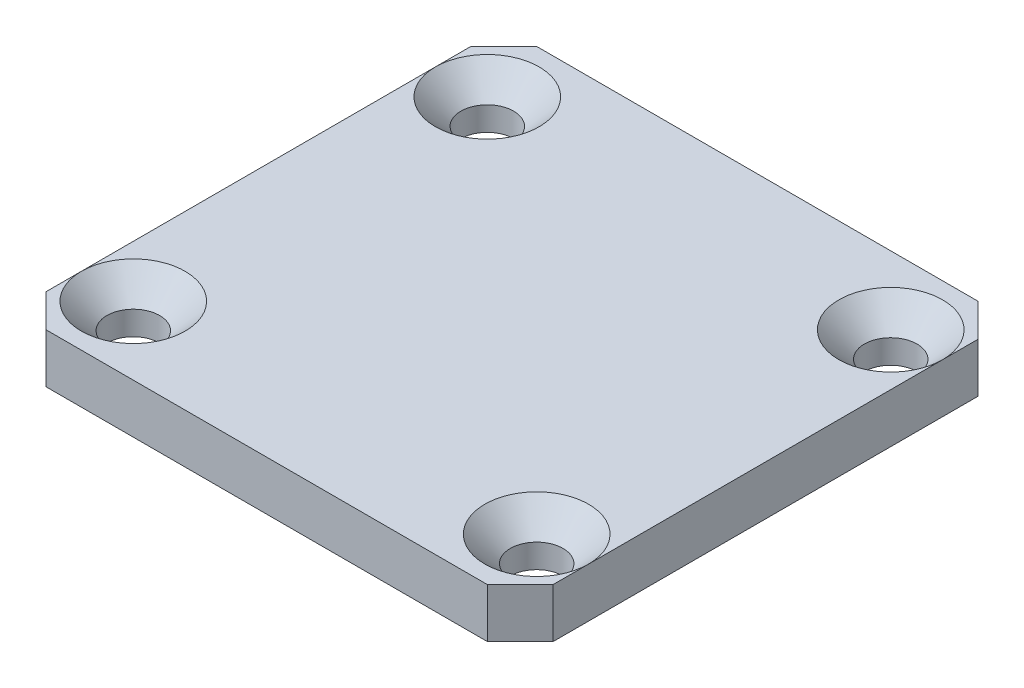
ISO-10303-21;
HEADER;
FILE_DESCRIPTION(('STEP AP214'),'2;1');
FILE_NAME('part.step','',(''),(''),'','','');
FILE_SCHEMA(('AUTOMOTIVE_DESIGN { 1 0 10303 214 1 1 1 1 }'));
ENDSEC;
DATA;
#1=APPLICATION_CONTEXT('core data for automotive mechanical design processes');
#2=APPLICATION_PROTOCOL_DEFINITION('international standard','automotive_design',2000,#1);
#3=PRODUCT_CONTEXT('',#1,'mechanical');
#4=PRODUCT('Part','Part','',(#3));
#5=PRODUCT_RELATED_PRODUCT_CATEGORY('part','',(#4));
#6=PRODUCT_DEFINITION_FORMATION('','',#4);
#7=PRODUCT_DEFINITION_CONTEXT('part definition',#1,'design');
#8=PRODUCT_DEFINITION('design','',#6,#7);
#9=PRODUCT_DEFINITION_SHAPE('','',#8);
#10=(LENGTH_UNIT() NAMED_UNIT(*) SI_UNIT(.MILLI.,.METRE.));
#11=(NAMED_UNIT(*) PLANE_ANGLE_UNIT() SI_UNIT($,.RADIAN.));
#12=(NAMED_UNIT(*) SI_UNIT($,.STERADIAN.) SOLID_ANGLE_UNIT());
#13=UNCERTAINTY_MEASURE_WITH_UNIT(LENGTH_MEASURE(1.E-05),#10,'distance_accuracy_value','');
#14=(GEOMETRIC_REPRESENTATION_CONTEXT(3) GLOBAL_UNCERTAINTY_ASSIGNED_CONTEXT((#13)) GLOBAL_UNIT_ASSIGNED_CONTEXT((#10,
#11,#12)) REPRESENTATION_CONTEXT('',''));
#15=CARTESIAN_POINT('',(0.,0.,0.));
#16=DIRECTION('',(0.,0.,1.));
#17=DIRECTION('',(1.,0.,0.));
#18=AXIS2_PLACEMENT_3D('',#15,#16,#17);
#19=CARTESIAN_POINT('',(-15.4,3.,14.9));
#20=DIRECTION('',(1.,0.,0.));
#21=DIRECTION('',(0.,0.,-1.));
#22=AXIS2_PLACEMENT_3D('',#19,#20,#21);
#23=PLANE('',#22);
#24=DIRECTION('',(0.,0.,1.));
#25=VECTOR('',#24,1.);
#26=CARTESIAN_POINT('',(-15.4,0.,14.9));
#27=LINE('',#26,#25);
#28=CARTESIAN_POINT('',(-15.4,0.,-12.9));
#29=VERTEX_POINT('',#28);
#30=CARTESIAN_POINT('',(-15.4,0.,12.9));
#31=VERTEX_POINT('',#30);
#32=EDGE_CURVE('E137',#29,#31,#27,.T.);
#33=ORIENTED_EDGE('',*,*,#32,.T.);
#34=DIRECTION('',(0.,1.,0.));
#35=VECTOR('',#34,1.);
#36=CARTESIAN_POINT('',(-15.4,3.,12.9));
#37=LINE('',#36,#35);
#38=CARTESIAN_POINT('',(-15.4,3.,12.9));
#39=VERTEX_POINT('',#38);
#40=EDGE_CURVE('E115',#31,#39,#37,.T.);
#41=ORIENTED_EDGE('',*,*,#40,.T.);
#42=DIRECTION('',(0.,0.,1.));
#43=VECTOR('',#42,1.);
#44=CARTESIAN_POINT('',(-15.4,3.,14.9));
#45=LINE('',#44,#43);
#46=CARTESIAN_POINT('',(-15.4,3.,10.75));
#47=VERTEX_POINT('',#46);
#48=EDGE_CURVE('E148',#47,#39,#45,.T.);
#49=ORIENTED_EDGE('',*,*,#48,.F.);
#50=CARTESIAN_POINT('',(-15.4,3.,-10.75));
#51=VERTEX_POINT('',#50);
#52=EDGE_CURVE('E191',#51,#47,#45,.T.);
#53=ORIENTED_EDGE('',*,*,#52,.F.);
#54=CARTESIAN_POINT('',(-15.4,3.,-12.9));
#55=VERTEX_POINT('',#54);
#56=EDGE_CURVE('E189',#55,#51,#45,.T.);
#57=ORIENTED_EDGE('',*,*,#56,.F.);
#58=DIRECTION('',(0.,-1.,0.));
#59=VECTOR('',#58,1.);
#60=CARTESIAN_POINT('',(-15.4,3.,-12.9));
#61=LINE('',#60,#59);
#62=EDGE_CURVE('E120',#55,#29,#61,.T.);
#63=ORIENTED_EDGE('',*,*,#62,.T.);
#64=EDGE_LOOP('',(#33,#41,#49,#53,#57,#63));
#65=FACE_BOUND('',#64,.T.);
#66=ADVANCED_FACE('F35',(#65),#23,.F.);
#67=CARTESIAN_POINT('',(15.4,3.,14.9));
#68=DIRECTION('',(0.,0.,-1.));
#69=DIRECTION('',(-1.,0.,0.));
#70=AXIS2_PLACEMENT_3D('',#67,#68,#69);
#71=PLANE('',#70);
#72=DIRECTION('',(1.,0.,0.));
#73=VECTOR('',#72,1.);
#74=CARTESIAN_POINT('',(15.4,3.,14.9));
#75=LINE('',#74,#73);
#76=CARTESIAN_POINT('',(-13.4,3.,14.9));
#77=VERTEX_POINT('',#76);
#78=CARTESIAN_POINT('',(13.4,3.,14.9));
#79=VERTEX_POINT('',#78);
#80=EDGE_CURVE('E130',#77,#79,#75,.T.);
#81=ORIENTED_EDGE('',*,*,#80,.F.);
#82=DIRECTION('',(0.,-1.,0.));
#83=VECTOR('',#82,1.);
#84=CARTESIAN_POINT('',(-13.4,3.,14.9));
#85=LINE('',#84,#83);
#86=CARTESIAN_POINT('',(-13.4,0.,14.9));
#87=VERTEX_POINT('',#86);
#88=EDGE_CURVE('E113',#77,#87,#85,.T.);
#89=ORIENTED_EDGE('',*,*,#88,.T.);
#90=DIRECTION('',(1.,0.,0.));
#91=VECTOR('',#90,1.);
#92=CARTESIAN_POINT('',(15.4,0.,14.9));
#93=LINE('',#92,#91);
#94=CARTESIAN_POINT('',(13.4,0.,14.9));
#95=VERTEX_POINT('',#94);
#96=EDGE_CURVE('E127',#87,#95,#93,.T.);
#97=ORIENTED_EDGE('',*,*,#96,.T.);
#98=DIRECTION('',(0.,1.,0.));
#99=VECTOR('',#98,1.);
#100=CARTESIAN_POINT('',(13.4,3.,14.9));
#101=LINE('',#100,#99);
#102=EDGE_CURVE('E132',#95,#79,#101,.T.);
#103=ORIENTED_EDGE('',*,*,#102,.T.);
#104=EDGE_LOOP('',(#81,#89,#97,#103));
#105=FACE_BOUND('',#104,.T.);
#106=ADVANCED_FACE('F126',(#105),#71,.F.);
#107=CARTESIAN_POINT('',(15.4,3.,14.9));
#108=DIRECTION('',(-1.,0.,0.));
#109=DIRECTION('',(0.,0.,1.));
#110=AXIS2_PLACEMENT_3D('',#107,#108,#109);
#111=PLANE('',#110);
#112=DIRECTION('',(0.,0.,-1.));
#113=VECTOR('',#112,1.);
#114=CARTESIAN_POINT('',(15.4,3.,14.9));
#115=LINE('',#114,#113);
#116=CARTESIAN_POINT('',(15.4,3.,12.9));
#117=VERTEX_POINT('',#116);
#118=CARTESIAN_POINT('',(15.4,3.,10.75));
#119=VERTEX_POINT('',#118);
#120=EDGE_CURVE('E259',#117,#119,#115,.T.);
#121=ORIENTED_EDGE('',*,*,#120,.F.);
#122=DIRECTION('',(0.,-1.,0.));
#123=VECTOR('',#122,1.);
#124=CARTESIAN_POINT('',(15.4,3.,12.9));
#125=LINE('',#124,#123);
#126=CARTESIAN_POINT('',(15.4,0.,12.9));
#127=VERTEX_POINT('',#126);
#128=EDGE_CURVE('E169',#117,#127,#125,.T.);
#129=ORIENTED_EDGE('',*,*,#128,.T.);
#130=DIRECTION('',(0.,0.,-1.));
#131=VECTOR('',#130,1.);
#132=CARTESIAN_POINT('',(15.4,0.,14.9));
#133=LINE('',#132,#131);
#134=CARTESIAN_POINT('',(15.4,0.,-12.9));
#135=VERTEX_POINT('',#134);
#136=EDGE_CURVE('E136',#127,#135,#133,.T.);
#137=ORIENTED_EDGE('',*,*,#136,.T.);
#138=DIRECTION('',(0.,1.,0.));
#139=VECTOR('',#138,1.);
#140=CARTESIAN_POINT('',(15.4,3.,-12.9));
#141=LINE('',#140,#139);
#142=CARTESIAN_POINT('',(15.4,3.,-12.9));
#143=VERTEX_POINT('',#142);
#144=EDGE_CURVE('E166',#135,#143,#141,.T.);
#145=ORIENTED_EDGE('',*,*,#144,.T.);
#146=CARTESIAN_POINT('',(15.4,3.,-10.75));
#147=VERTEX_POINT('',#146);
#148=EDGE_CURVE('E195',#147,#143,#115,.T.);
#149=ORIENTED_EDGE('',*,*,#148,.F.);
#150=EDGE_CURVE('E257',#119,#147,#115,.T.);
#151=ORIENTED_EDGE('',*,*,#150,.F.);
#152=EDGE_LOOP('',(#121,#129,#137,#145,#149,#151));
#153=FACE_BOUND('',#152,.T.);
#154=ADVANCED_FACE('F238',(#153),#111,.F.);
#155=CARTESIAN_POINT('',(15.4,3.,-14.9));
#156=DIRECTION('',(0.,0.,1.));
#157=DIRECTION('',(1.,0.,0.));
#158=AXIS2_PLACEMENT_3D('',#155,#156,#157);
#159=PLANE('',#158);
#160=DIRECTION('',(-1.,0.,0.));
#161=VECTOR('',#160,1.);
#162=CARTESIAN_POINT('',(15.4,0.,-14.9));
#163=LINE('',#162,#161);
#164=CARTESIAN_POINT('',(13.4,0.,-14.9));
#165=VERTEX_POINT('',#164);
#166=CARTESIAN_POINT('',(-13.4,0.,-14.9));
#167=VERTEX_POINT('',#166);
#168=EDGE_CURVE('E140',#165,#167,#163,.T.);
#169=ORIENTED_EDGE('',*,*,#168,.T.);
#170=DIRECTION('',(0.,1.,0.));
#171=VECTOR('',#170,1.);
#172=CARTESIAN_POINT('',(-13.4,3.,-14.9));
#173=LINE('',#172,#171);
#174=CARTESIAN_POINT('',(-13.4,3.,-14.9));
#175=VERTEX_POINT('',#174);
#176=EDGE_CURVE('E11',#167,#175,#173,.T.);
#177=ORIENTED_EDGE('',*,*,#176,.T.);
#178=DIRECTION('',(-1.,0.,0.));
#179=VECTOR('',#178,1.);
#180=CARTESIAN_POINT('',(15.4,3.,-14.9));
#181=LINE('',#180,#179);
#182=CARTESIAN_POINT('',(13.4,3.,-14.9));
#183=VERTEX_POINT('',#182);
#184=EDGE_CURVE('E149',#183,#175,#181,.T.);
#185=ORIENTED_EDGE('',*,*,#184,.F.);
#186=DIRECTION('',(0.,-1.,0.));
#187=VECTOR('',#186,1.);
#188=CARTESIAN_POINT('',(13.4,3.,-14.9));
#189=LINE('',#188,#187);
#190=EDGE_CURVE('E43',#183,#165,#189,.T.);
#191=ORIENTED_EDGE('',*,*,#190,.T.);
#192=EDGE_LOOP('',(#169,#177,#185,#191));
#193=FACE_BOUND('',#192,.T.);
#194=ADVANCED_FACE('F176',(#193),#159,.F.);
#195=CARTESIAN_POINT('',(-15.4,3.,-14.9));
#196=DIRECTION('',(0.,1.,0.));
#197=DIRECTION('',(0.,0.,1.));
#198=AXIS2_PLACEMENT_3D('',#195,#196,#197);
#199=PLANE('',#198);
#200=ORIENTED_EDGE('',*,*,#150,.T.);
#201=CARTESIAN_POINT('',(12.25,3.,-10.75));
#202=DIRECTION('',(0.,1.,0.));
#203=DIRECTION('',(0.,0.,1.));
#204=AXIS2_PLACEMENT_3D('',#201,#202,#203);
#205=CIRCLE('',#204,3.15);
#206=EDGE_CURVE('E48',#147,#147,#205,.T.);
#207=ORIENTED_EDGE('',*,*,#206,.F.);
#208=ORIENTED_EDGE('',*,*,#148,.T.);
#209=DIRECTION('',(0.707106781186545,0.,0.70710678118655));
#210=VECTOR('',#209,1.);
#211=CARTESIAN_POINT('',(-0.999999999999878,3.,-29.3));
#212=LINE('',#211,#210);
#213=EDGE_CURVE('E158',#143,#183,#212,.F.);
#214=ORIENTED_EDGE('',*,*,#213,.T.);
#215=ORIENTED_EDGE('',*,*,#184,.T.);
#216=DIRECTION('',(0.707106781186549,0.,-0.707106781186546));
#217=VECTOR('',#216,1.);
#218=CARTESIAN_POINT('',(-14.4,3.,-13.9));
#219=LINE('',#218,#217);
#220=EDGE_CURVE('E160',#175,#55,#219,.F.);
#221=ORIENTED_EDGE('',*,*,#220,.T.);
#222=ORIENTED_EDGE('',*,*,#56,.T.);
#223=CARTESIAN_POINT('',(-12.25,3.,-10.75));
#224=DIRECTION('',(0.,1.,0.));
#225=DIRECTION('',(0.,0.,1.));
#226=AXIS2_PLACEMENT_3D('',#223,#224,#225);
#227=CIRCLE('',#226,3.15);
#228=EDGE_CURVE('E277',#51,#51,#227,.T.);
#229=ORIENTED_EDGE('',*,*,#228,.F.);
#230=ORIENTED_EDGE('',*,*,#52,.T.);
#231=CARTESIAN_POINT('',(-12.25,3.,10.75));
#232=DIRECTION('',(0.,1.,0.));
#233=DIRECTION('',(0.,0.,1.));
#234=AXIS2_PLACEMENT_3D('',#231,#232,#233);
#235=CIRCLE('',#234,3.15);
#236=EDGE_CURVE('E202',#47,#47,#235,.T.);
#237=ORIENTED_EDGE('',*,*,#236,.F.);
#238=ORIENTED_EDGE('',*,*,#48,.T.);
#239=DIRECTION('',(-0.707106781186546,0.,-0.707106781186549));
#240=VECTOR('',#239,1.);
#241=CARTESIAN_POINT('',(-29.3,3.,-1.00000000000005));
#242=LINE('',#241,#240);
#243=EDGE_CURVE('E164',#39,#77,#242,.F.);
#244=ORIENTED_EDGE('',*,*,#243,.T.);
#245=ORIENTED_EDGE('',*,*,#80,.T.);
#246=DIRECTION('',(-0.707106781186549,0.,0.707106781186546));
#247=VECTOR('',#246,1.);
#248=CARTESIAN_POINT('',(13.9,3.,14.4));
#249=LINE('',#248,#247);
#250=EDGE_CURVE('E162',#79,#117,#249,.F.);
#251=ORIENTED_EDGE('',*,*,#250,.T.);
#252=ORIENTED_EDGE('',*,*,#120,.T.);
#253=CARTESIAN_POINT('',(12.25,3.,10.75));
#254=DIRECTION('',(0.,1.,0.));
#255=DIRECTION('',(0.,0.,1.));
#256=AXIS2_PLACEMENT_3D('',#253,#254,#255);
#257=CIRCLE('',#256,3.15);
#258=EDGE_CURVE('E53',#119,#119,#257,.T.);
#259=ORIENTED_EDGE('',*,*,#258,.F.);
#260=EDGE_LOOP('',(#200,#207,#208,#214,#215,#221,#222,#229,#230,#237,#238,#244,#245,#251,#252,#259));
#261=FACE_BOUND('',#260,.T.);
#262=ADVANCED_FACE('F200',(#261),#199,.T.);
#263=CARTESIAN_POINT('',(-15.4,0.,-14.9));
#264=DIRECTION('',(0.,1.,0.));
#265=DIRECTION('',(0.,0.,1.));
#266=AXIS2_PLACEMENT_3D('',#263,#264,#265);
#267=PLANE('',#266);
#268=CARTESIAN_POINT('',(12.25,0.,-10.75));
#269=DIRECTION('',(0.,1.,0.));
#270=DIRECTION('',(0.,0.,1.));
#271=AXIS2_PLACEMENT_3D('',#268,#269,#270);
#272=CIRCLE('',#271,1.6);
#273=CARTESIAN_POINT('',(12.25,0.,-9.15));
#274=VERTEX_POINT('',#273);
#275=EDGE_CURVE('E265',#274,#274,#272,.T.);
#276=ORIENTED_EDGE('',*,*,#275,.T.);
#277=EDGE_LOOP('',(#276));
#278=FACE_BOUND('',#277,.T.);
#279=CARTESIAN_POINT('',(12.25,0.,10.75));
#280=DIRECTION('',(0.,1.,0.));
#281=DIRECTION('',(0.,0.,1.));
#282=AXIS2_PLACEMENT_3D('',#279,#280,#281);
#283=CIRCLE('',#282,1.6);
#284=CARTESIAN_POINT('',(12.25,0.,12.35));
#285=VERTEX_POINT('',#284);
#286=EDGE_CURVE('E268',#285,#285,#283,.T.);
#287=ORIENTED_EDGE('',*,*,#286,.T.);
#288=EDGE_LOOP('',(#287));
#289=FACE_BOUND('',#288,.T.);
#290=CARTESIAN_POINT('',(-12.25,0.,-10.75));
#291=DIRECTION('',(0.,1.,0.));
#292=DIRECTION('',(0.,0.,1.));
#293=AXIS2_PLACEMENT_3D('',#290,#291,#292);
#294=CIRCLE('',#293,1.6);
#295=CARTESIAN_POINT('',(-12.25,0.,-9.15));
#296=VERTEX_POINT('',#295);
#297=EDGE_CURVE('E205',#296,#296,#294,.T.);
#298=ORIENTED_EDGE('',*,*,#297,.T.);
#299=EDGE_LOOP('',(#298));
#300=FACE_BOUND('',#299,.T.);
#301=CARTESIAN_POINT('',(-12.25,0.,10.75));
#302=DIRECTION('',(0.,1.,0.));
#303=DIRECTION('',(0.,0.,1.));
#304=AXIS2_PLACEMENT_3D('',#301,#302,#303);
#305=CIRCLE('',#304,1.6);
#306=CARTESIAN_POINT('',(-12.25,0.,12.35));
#307=VERTEX_POINT('',#306);
#308=EDGE_CURVE('E142',#307,#307,#305,.T.);
#309=ORIENTED_EDGE('',*,*,#308,.T.);
#310=EDGE_LOOP('',(#309));
#311=FACE_BOUND('',#310,.T.);
#312=ORIENTED_EDGE('',*,*,#96,.F.);
#313=DIRECTION('',(0.707106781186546,0.,0.707106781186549));
#314=VECTOR('',#313,1.);
#315=CARTESIAN_POINT('',(-13.4,0.,14.9));
#316=LINE('',#315,#314);
#317=EDGE_CURVE('E109',#87,#31,#316,.F.);
#318=ORIENTED_EDGE('',*,*,#317,.T.);
#319=ORIENTED_EDGE('',*,*,#32,.F.);
#320=DIRECTION('',(-0.707106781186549,0.,0.707106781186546));
#321=VECTOR('',#320,1.);
#322=CARTESIAN_POINT('',(-15.4,0.,-12.9));
#323=LINE('',#322,#321);
#324=EDGE_CURVE('E152',#29,#167,#323,.F.);
#325=ORIENTED_EDGE('',*,*,#324,.T.);
#326=ORIENTED_EDGE('',*,*,#168,.F.);
#327=DIRECTION('',(-0.707106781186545,0.,-0.70710678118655));
#328=VECTOR('',#327,1.);
#329=CARTESIAN_POINT('',(13.4,0.,-14.9));
#330=LINE('',#329,#328);
#331=EDGE_CURVE('E131',#165,#135,#330,.F.);
#332=ORIENTED_EDGE('',*,*,#331,.T.);
#333=ORIENTED_EDGE('',*,*,#136,.F.);
#334=DIRECTION('',(0.707106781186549,0.,-0.707106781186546));
#335=VECTOR('',#334,1.);
#336=CARTESIAN_POINT('',(15.4,0.,12.9));
#337=LINE('',#336,#335);
#338=EDGE_CURVE('E121',#127,#95,#337,.F.);
#339=ORIENTED_EDGE('',*,*,#338,.T.);
#340=EDGE_LOOP('',(#312,#318,#319,#325,#326,#332,#333,#339));
#341=FACE_BOUND('',#340,.T.);
#342=ADVANCED_FACE('F134',(#278,#289,#300,#311,#341),#267,.F.);
#343=CARTESIAN_POINT('',(-13.4,3.,14.9));
#344=DIRECTION('',(0.707106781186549,0.,-0.707106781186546));
#345=DIRECTION('',(-0.707106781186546,0.,-0.707106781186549));
#346=AXIS2_PLACEMENT_3D('',#343,#344,#345);
#347=PLANE('',#346);
#348=ORIENTED_EDGE('',*,*,#243,.F.);
#349=ORIENTED_EDGE('',*,*,#40,.F.);
#350=ORIENTED_EDGE('',*,*,#317,.F.);
#351=ORIENTED_EDGE('',*,*,#88,.F.);
#352=EDGE_LOOP('',(#348,#349,#350,#351));
#353=FACE_BOUND('',#352,.T.);
#354=ADVANCED_FACE('F112',(#353),#347,.F.);
#355=CARTESIAN_POINT('',(15.4,3.,12.9));
#356=DIRECTION('',(-0.707106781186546,0.,-0.707106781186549));
#357=DIRECTION('',(-0.707106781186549,0.,0.707106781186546));
#358=AXIS2_PLACEMENT_3D('',#355,#356,#357);
#359=PLANE('',#358);
#360=ORIENTED_EDGE('',*,*,#250,.F.);
#361=ORIENTED_EDGE('',*,*,#102,.F.);
#362=ORIENTED_EDGE('',*,*,#338,.F.);
#363=ORIENTED_EDGE('',*,*,#128,.F.);
#364=EDGE_LOOP('',(#360,#361,#362,#363));
#365=FACE_BOUND('',#364,.T.);
#366=ADVANCED_FACE('F244',(#365),#359,.F.);
#367=CARTESIAN_POINT('',(-15.4,3.,-12.9));
#368=DIRECTION('',(0.707106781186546,0.,0.707106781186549));
#369=DIRECTION('',(0.707106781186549,0.,-0.707106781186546));
#370=AXIS2_PLACEMENT_3D('',#367,#368,#369);
#371=PLANE('',#370);
#372=ORIENTED_EDGE('',*,*,#220,.F.);
#373=ORIENTED_EDGE('',*,*,#176,.F.);
#374=ORIENTED_EDGE('',*,*,#324,.F.);
#375=ORIENTED_EDGE('',*,*,#62,.F.);
#376=EDGE_LOOP('',(#372,#373,#374,#375));
#377=FACE_BOUND('',#376,.T.);
#378=ADVANCED_FACE('F184',(#377),#371,.F.);
#379=CARTESIAN_POINT('',(13.4,3.,-14.9));
#380=DIRECTION('',(-0.70710678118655,0.,0.707106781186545));
#381=DIRECTION('',(0.707106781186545,0.,0.70710678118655));
#382=AXIS2_PLACEMENT_3D('',#379,#380,#381);
#383=PLANE('',#382);
#384=ORIENTED_EDGE('',*,*,#213,.F.);
#385=ORIENTED_EDGE('',*,*,#144,.F.);
#386=ORIENTED_EDGE('',*,*,#331,.F.);
#387=ORIENTED_EDGE('',*,*,#190,.F.);
#388=EDGE_LOOP('',(#384,#385,#386,#387));
#389=FACE_BOUND('',#388,.T.);
#390=ADVANCED_FACE('F37',(#389),#383,.F.);
#391=CARTESIAN_POINT('',(-12.25,3.,10.75));
#392=DIRECTION('',(0.,1.,0.));
#393=DIRECTION('',(0.,0.,1.));
#394=AXIS2_PLACEMENT_3D('',#391,#392,#393);
#395=CYLINDRICAL_SURFACE('',#394,1.6);
#396=ORIENTED_EDGE('',*,*,#308,.F.);
#397=EDGE_LOOP('',(#396));
#398=FACE_BOUND('',#397,.T.);
#399=CARTESIAN_POINT('',(-12.25,1.45,10.75));
#400=DIRECTION('',(0.,1.,0.));
#401=DIRECTION('',(0.,0.,1.));
#402=AXIS2_PLACEMENT_3D('',#399,#400,#401);
#403=CIRCLE('',#402,1.6);
#404=CARTESIAN_POINT('',(-12.25,1.45,12.35));
#405=VERTEX_POINT('',#404);
#406=EDGE_CURVE('E204',#405,#405,#403,.T.);
#407=ORIENTED_EDGE('',*,*,#406,.T.);
#408=EDGE_LOOP('',(#407));
#409=FACE_BOUND('',#408,.T.);
#410=ADVANCED_FACE('F217',(#398,#409),#395,.F.);
#411=CARTESIAN_POINT('',(-12.25,3.,10.75));
#412=DIRECTION('',(0.,1.,0.));
#413=DIRECTION('',(0.,0.,1.));
#414=AXIS2_PLACEMENT_3D('',#411,#412,#413);
#415=CONICAL_SURFACE('',#414,3.15,0.785398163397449);
#416=ORIENTED_EDGE('',*,*,#406,.F.);
#417=EDGE_LOOP('',(#416));
#418=FACE_BOUND('',#417,.T.);
#419=ORIENTED_EDGE('',*,*,#236,.T.);
#420=EDGE_LOOP('',(#419));
#421=FACE_BOUND('',#420,.T.);
#422=ADVANCED_FACE('F220',(#418,#421),#415,.F.);
#423=CARTESIAN_POINT('',(-12.25,3.,-10.75));
#424=DIRECTION('',(0.,1.,0.));
#425=DIRECTION('',(0.,0.,1.));
#426=AXIS2_PLACEMENT_3D('',#423,#424,#425);
#427=CYLINDRICAL_SURFACE('',#426,1.6);
#428=ORIENTED_EDGE('',*,*,#297,.F.);
#429=EDGE_LOOP('',(#428));
#430=FACE_BOUND('',#429,.T.);
#431=CARTESIAN_POINT('',(-12.25,1.45,-10.75));
#432=DIRECTION('',(0.,1.,0.));
#433=DIRECTION('',(0.,0.,1.));
#434=AXIS2_PLACEMENT_3D('',#431,#432,#433);
#435=CIRCLE('',#434,1.6);
#436=CARTESIAN_POINT('',(-12.25,1.45,-9.15));
#437=VERTEX_POINT('',#436);
#438=EDGE_CURVE('E210',#437,#437,#435,.T.);
#439=ORIENTED_EDGE('',*,*,#438,.T.);
#440=EDGE_LOOP('',(#439));
#441=FACE_BOUND('',#440,.T.);
#442=ADVANCED_FACE('F225',(#430,#441),#427,.F.);
#443=CARTESIAN_POINT('',(-12.25,3.,-10.75));
#444=DIRECTION('',(0.,1.,0.));
#445=DIRECTION('',(0.,0.,1.));
#446=AXIS2_PLACEMENT_3D('',#443,#444,#445);
#447=CONICAL_SURFACE('',#446,3.15,0.785398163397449);
#448=ORIENTED_EDGE('',*,*,#438,.F.);
#449=EDGE_LOOP('',(#448));
#450=FACE_BOUND('',#449,.T.);
#451=ORIENTED_EDGE('',*,*,#228,.T.);
#452=EDGE_LOOP('',(#451));
#453=FACE_BOUND('',#452,.T.);
#454=ADVANCED_FACE('F230',(#450,#453),#447,.F.);
#455=CARTESIAN_POINT('',(12.25,3.,10.75));
#456=DIRECTION('',(0.,1.,0.));
#457=DIRECTION('',(0.,0.,1.));
#458=AXIS2_PLACEMENT_3D('',#455,#456,#457);
#459=CYLINDRICAL_SURFACE('',#458,1.6);
#460=ORIENTED_EDGE('',*,*,#286,.F.);
#461=EDGE_LOOP('',(#460));
#462=FACE_BOUND('',#461,.T.);
#463=CARTESIAN_POINT('',(12.25,1.45,10.75));
#464=DIRECTION('',(0.,1.,0.));
#465=DIRECTION('',(0.,0.,1.));
#466=AXIS2_PLACEMENT_3D('',#463,#464,#465);
#467=CIRCLE('',#466,1.6);
#468=CARTESIAN_POINT('',(12.25,1.45,12.35));
#469=VERTEX_POINT('',#468);
#470=EDGE_CURVE('E264',#469,#469,#467,.T.);
#471=ORIENTED_EDGE('',*,*,#470,.T.);
#472=EDGE_LOOP('',(#471));
#473=FACE_BOUND('',#472,.T.);
#474=ADVANCED_FACE('F284',(#462,#473),#459,.F.);
#475=CARTESIAN_POINT('',(12.25,3.,10.75));
#476=DIRECTION('',(0.,1.,0.));
#477=DIRECTION('',(0.,0.,1.));
#478=AXIS2_PLACEMENT_3D('',#475,#476,#477);
#479=CONICAL_SURFACE('',#478,3.15,0.785398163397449);
#480=ORIENTED_EDGE('',*,*,#470,.F.);
#481=EDGE_LOOP('',(#480));
#482=FACE_BOUND('',#481,.T.);
#483=ORIENTED_EDGE('',*,*,#258,.T.);
#484=EDGE_LOOP('',(#483));
#485=FACE_BOUND('',#484,.T.);
#486=ADVANCED_FACE('F289',(#482,#485),#479,.F.);
#487=CARTESIAN_POINT('',(12.25,3.,-10.75));
#488=DIRECTION('',(0.,1.,0.));
#489=DIRECTION('',(0.,0.,1.));
#490=AXIS2_PLACEMENT_3D('',#487,#488,#489);
#491=CYLINDRICAL_SURFACE('',#490,1.6);
#492=ORIENTED_EDGE('',*,*,#275,.F.);
#493=EDGE_LOOP('',(#492));
#494=FACE_BOUND('',#493,.T.);
#495=CARTESIAN_POINT('',(12.25,1.45,-10.75));
#496=DIRECTION('',(0.,1.,0.));
#497=DIRECTION('',(0.,0.,1.));
#498=AXIS2_PLACEMENT_3D('',#495,#496,#497);
#499=CIRCLE('',#498,1.6);
#500=CARTESIAN_POINT('',(12.25,1.45,-9.15));
#501=VERTEX_POINT('',#500);
#502=EDGE_CURVE('E271',#501,#501,#499,.T.);
#503=ORIENTED_EDGE('',*,*,#502,.T.);
#504=EDGE_LOOP('',(#503));
#505=FACE_BOUND('',#504,.T.);
#506=ADVANCED_FACE('F295',(#494,#505),#491,.F.);
#507=CARTESIAN_POINT('',(12.25,3.,-10.75));
#508=DIRECTION('',(0.,1.,0.));
#509=DIRECTION('',(0.,0.,1.));
#510=AXIS2_PLACEMENT_3D('',#507,#508,#509);
#511=CONICAL_SURFACE('',#510,3.15,0.785398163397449);
#512=ORIENTED_EDGE('',*,*,#502,.F.);
#513=EDGE_LOOP('',(#512));
#514=FACE_BOUND('',#513,.T.);
#515=ORIENTED_EDGE('',*,*,#206,.T.);
#516=EDGE_LOOP('',(#515));
#517=FACE_BOUND('',#516,.T.);
#518=ADVANCED_FACE('F299',(#514,#517),#511,.F.);
#519=CLOSED_SHELL('',(#66,#106,#154,#194,#262,#342,#354,#366,#378,#390,#410,#422,#442,#454,#474,
#486,#506,#518));
#520=MANIFOLD_SOLID_BREP('B2',#519);
#521=ADVANCED_BREP_SHAPE_REPRESENTATION('',(#18,#520),#14);
#522=SHAPE_DEFINITION_REPRESENTATION(#9,#521);
ENDSEC;
END-ISO-10303-21;
